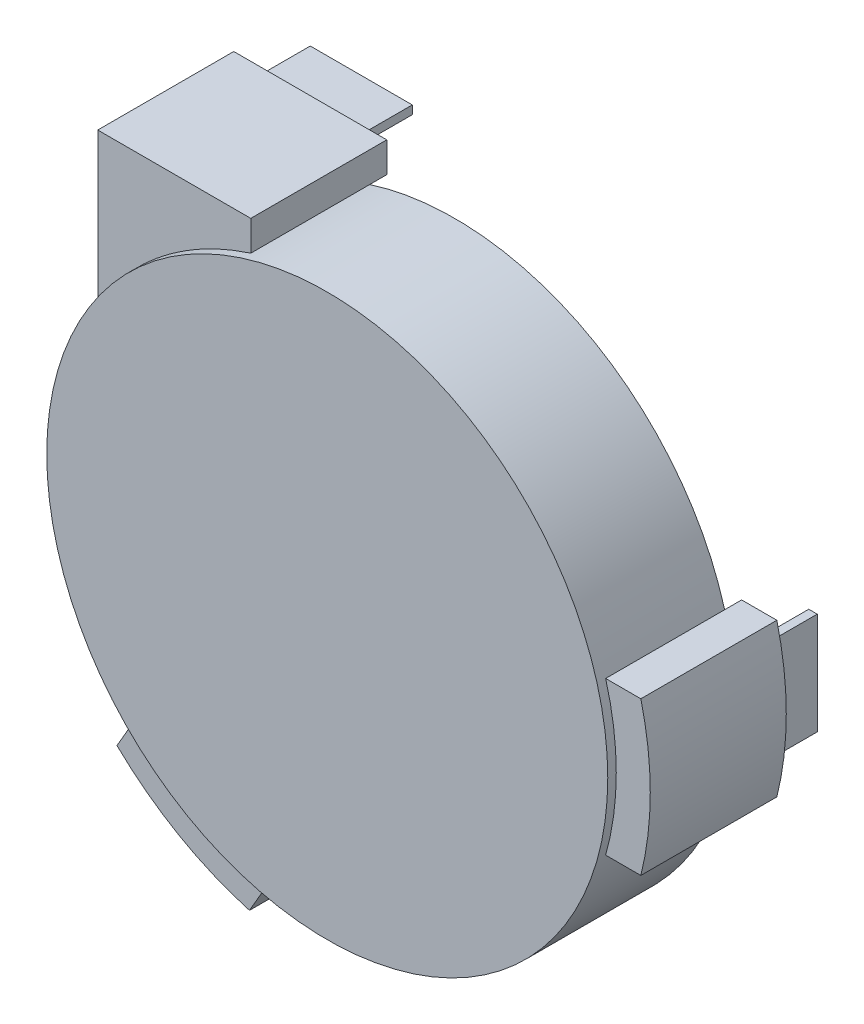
from build123d import *

# Parameters (mm, degrees)
ESQUISSE1_R        = 16.5
EXTRUSION1_DEPTH   = 7.5
EXTRUSION2_DEPTH   = 8
EXTRUSION2_2_DEPTH = 8
EXTRUSION2_3_DEPTH = 8
ESQUISSE3_W        = 0.5
ESQUISSE3_H        = 6
ESQUISSE3_W_2      = 6
ESQUISSE3_H_2      = 0.5
EXTRUSION3_DEPTH   = 3


with BuildPart() as part:
    # Esquisse1 → Extrusion1 (new body)
    with BuildSketch(Plane.XY):
        Circle(ESQUISSE1_R)
    extrude(amount=EXTRUSION1_DEPTH)


with BuildPart() as body_2:
    # Esquisse2 → Extrusion2 (new body)
    with BuildSketch(Plane.XY.offset(7)):
        with BuildLine():
            Line((15.874507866, -4.5), (17.944358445, -4.5))
            ThreePointArc((17.944358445, -4.5), (18.5, 0), (17.944358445, 4.5))
            Line((17.944358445, 4.5), (15.874507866, 4.5))
            ThreePointArc((15.874507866, 4.5), (16.5, 0), (15.874507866, -4.5))
        make_face()
    extrude(amount=-EXTRUSION2_DEPTH)



with BuildPart() as body_3:
    # Esquisse2 → Extrusion2 2 (new body)
    with BuildSketch(Plane.XY.offset(7)):
        with BuildLine():
            Line((-11.83436825, -11.497727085), (-12.869293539, -13.290270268))
            ThreePointArc((-12.869293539, -13.290270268), (-9.25, -16.02146997), (-5.075064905, -17.790270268))
            Line((-5.075064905, -17.790270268), (-4.040139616, -15.997727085))
            ThreePointArc((-4.040139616, -15.997727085), (-8.25, -14.289419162), (-11.83436825, -11.497727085))
        make_face()
    extrude(amount=-EXTRUSION2_2_DEPTH)


with BuildPart() as body_4:
    # Esquisse2 → Extrusion2 3 (new body)
    with BuildSketch(Plane.XY.offset(7)):
        with BuildLine():
            Line((-5, 15.724185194), (-5, 17.5))
            Line((-5, 17.5), (-14, 17.5))
            Line((-14, 17.5), (-14, 8.732124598))
            ThreePointArc((-14, 8.732124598), (-10.122856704, 13.029879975), (-5, 15.724185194))
        make_face()
    extrude(amount=-EXTRUSION2_3_DEPTH)


with BuildPart() as body_2_1:
    add(body_2.part)

    add(body_3.part)  # Extrusion3 merges body 3

    add(body_4.part)  # Extrusion3 merges body 4
    # Esquisse3 → Extrusion3 (add)
    with BuildSketch(Plane(origin=(0, 0, -1), x_dir=(-1, 0, 0), z_dir=(0, 0, -1))):
        with Locations((-17.071633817, 0)):
            Rectangle(ESQUISSE3_W, ESQUISSE3_H)
        Polygon((6.062740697, -16.500974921), (11.25889312, -13.500974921), (11.00889312, -13.067962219), (5.812740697, -16.067962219), align=None)
        with Locations((9.5, 16.779676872)):
            Rectangle(ESQUISSE3_W_2, ESQUISSE3_H_2)
    extrude(amount=EXTRUSION3_DEPTH)


solid = Compound([part.part, body_2_1.part])
